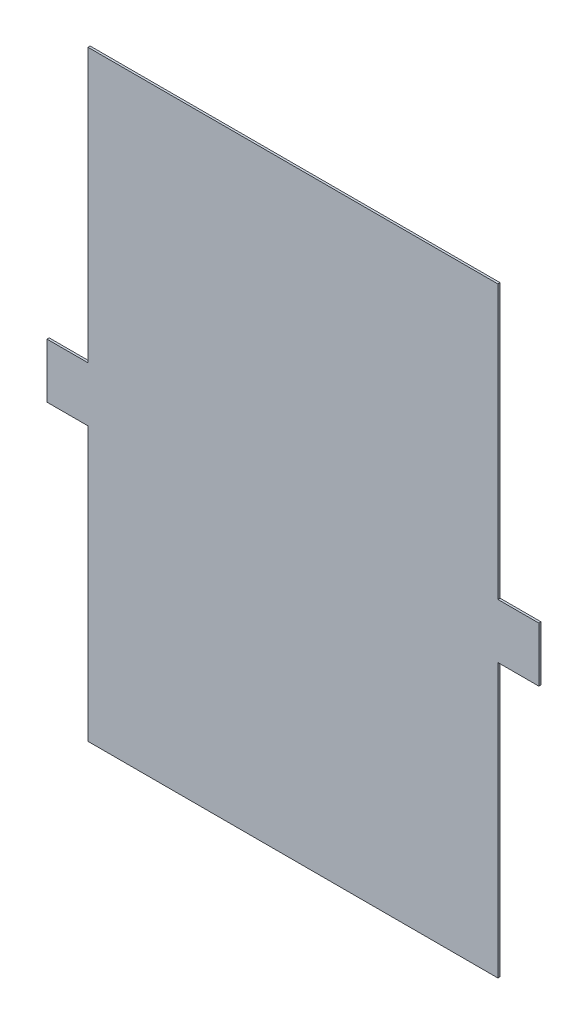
ISO-10303-21;
HEADER;
FILE_DESCRIPTION(('STEP AP214'),'2;1');
FILE_NAME('part.step','',(''),(''),'','','');
FILE_SCHEMA(('AUTOMOTIVE_DESIGN { 1 0 10303 214 1 1 1 1 }'));
ENDSEC;
DATA;
#1=APPLICATION_CONTEXT('core data for automotive mechanical design processes');
#2=APPLICATION_PROTOCOL_DEFINITION('international standard','automotive_design',2000,#1);
#3=PRODUCT_CONTEXT('',#1,'mechanical');
#4=PRODUCT('Part','Part','',(#3));
#5=PRODUCT_RELATED_PRODUCT_CATEGORY('part','',(#4));
#6=PRODUCT_DEFINITION_FORMATION('','',#4);
#7=PRODUCT_DEFINITION_CONTEXT('part definition',#1,'design');
#8=PRODUCT_DEFINITION('design','',#6,#7);
#9=PRODUCT_DEFINITION_SHAPE('','',#8);
#10=(LENGTH_UNIT() NAMED_UNIT(*) SI_UNIT(.MILLI.,.METRE.));
#11=(NAMED_UNIT(*) PLANE_ANGLE_UNIT() SI_UNIT($,.RADIAN.));
#12=(NAMED_UNIT(*) SI_UNIT($,.STERADIAN.) SOLID_ANGLE_UNIT());
#13=UNCERTAINTY_MEASURE_WITH_UNIT(LENGTH_MEASURE(1.E-05),#10,'distance_accuracy_value','');
#14=(GEOMETRIC_REPRESENTATION_CONTEXT(3) GLOBAL_UNCERTAINTY_ASSIGNED_CONTEXT((#13)) GLOBAL_UNIT_ASSIGNED_CONTEXT((#10,
#11,#12)) REPRESENTATION_CONTEXT('',''));
#15=CARTESIAN_POINT('',(0.,0.,0.));
#16=DIRECTION('',(0.,0.,1.));
#17=DIRECTION('',(1.,0.,0.));
#18=AXIS2_PLACEMENT_3D('',#15,#16,#17);
#19=CARTESIAN_POINT('',(-251.568085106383,267.960992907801,2.032));
#20=DIRECTION('',(1.,0.,0.));
#21=DIRECTION('',(0.,0.,-1.));
#22=AXIS2_PLACEMENT_3D('',#19,#20,#21);
#23=PLANE('',#22);
#24=DIRECTION('',(0.,-1.,0.));
#25=VECTOR('',#24,1.);
#26=CARTESIAN_POINT('',(-251.568085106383,267.960992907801,0.));
#27=LINE('',#26,#25);
#28=CARTESIAN_POINT('',(-251.568085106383,267.960992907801,0.));
#29=VERTEX_POINT('',#28);
#30=CARTESIAN_POINT('',(-251.568085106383,13.9609929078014,0.));
#31=VERTEX_POINT('',#30);
#32=EDGE_CURVE('E153',#29,#31,#27,.T.);
#33=ORIENTED_EDGE('',*,*,#32,.T.);
#34=DIRECTION('',(0.,0.,-1.));
#35=VECTOR('',#34,1.);
#36=CARTESIAN_POINT('',(-251.568085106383,13.9609929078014,2.032));
#37=LINE('',#36,#35);
#38=CARTESIAN_POINT('',(-251.568085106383,13.9609929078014,2.032));
#39=VERTEX_POINT('',#38);
#40=EDGE_CURVE('E11',#39,#31,#37,.T.);
#41=ORIENTED_EDGE('',*,*,#40,.F.);
#42=DIRECTION('',(0.,-1.,0.));
#43=VECTOR('',#42,1.);
#44=CARTESIAN_POINT('',(-251.568085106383,267.960992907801,2.032));
#45=LINE('',#44,#43);
#46=CARTESIAN_POINT('',(-251.568085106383,267.960992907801,2.032));
#47=VERTEX_POINT('',#46);
#48=EDGE_CURVE('E175',#47,#39,#45,.T.);
#49=ORIENTED_EDGE('',*,*,#48,.F.);
#50=DIRECTION('',(0.,0.,-1.));
#51=VECTOR('',#50,1.);
#52=CARTESIAN_POINT('',(-251.568085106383,267.960992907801,2.032));
#53=LINE('',#52,#51);
#54=EDGE_CURVE('E149',#47,#29,#53,.T.);
#55=ORIENTED_EDGE('',*,*,#54,.T.);
#56=EDGE_LOOP('',(#33,#41,#49,#55));
#57=FACE_BOUND('',#56,.T.);
#58=ADVANCED_FACE('F33',(#57),#23,.F.);
#59=CARTESIAN_POINT('',(-251.568085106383,13.9609929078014,2.032));
#60=DIRECTION('',(0.,-1.,0.));
#61=DIRECTION('',(1.,0.,0.));
#62=AXIS2_PLACEMENT_3D('',#59,#60,#61);
#63=PLANE('',#62);
#64=DIRECTION('',(-1.,0.,0.));
#65=VECTOR('',#64,1.);
#66=CARTESIAN_POINT('',(-251.568085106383,13.9609929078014,0.));
#67=LINE('',#66,#65);
#68=CARTESIAN_POINT('',(-289.668085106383,13.9609929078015,0.));
#69=VERTEX_POINT('',#68);
#70=EDGE_CURVE('E156',#31,#69,#67,.T.);
#71=ORIENTED_EDGE('',*,*,#70,.T.);
#72=DIRECTION('',(0.,0.,-1.));
#73=VECTOR('',#72,1.);
#74=CARTESIAN_POINT('',(-289.668085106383,13.9609929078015,2.032));
#75=LINE('',#74,#73);
#76=CARTESIAN_POINT('',(-289.668085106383,13.9609929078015,2.032));
#77=VERTEX_POINT('',#76);
#78=EDGE_CURVE('E41',#77,#69,#75,.T.);
#79=ORIENTED_EDGE('',*,*,#78,.F.);
#80=DIRECTION('',(-1.,0.,0.));
#81=VECTOR('',#80,1.);
#82=CARTESIAN_POINT('',(-251.568085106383,13.9609929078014,2.032));
#83=LINE('',#82,#81);
#84=EDGE_CURVE('E104',#39,#77,#83,.T.);
#85=ORIENTED_EDGE('',*,*,#84,.F.);
#86=ORIENTED_EDGE('',*,*,#40,.T.);
#87=EDGE_LOOP('',(#71,#79,#85,#86));
#88=FACE_BOUND('',#87,.T.);
#89=ADVANCED_FACE('F253',(#88),#63,.F.);
#90=CARTESIAN_POINT('',(-289.668085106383,13.9609929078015,2.032));
#91=DIRECTION('',(1.,0.,0.));
#92=DIRECTION('',(0.,0.,-1.));
#93=AXIS2_PLACEMENT_3D('',#90,#91,#92);
#94=PLANE('',#93);
#95=DIRECTION('',(0.,-1.,0.));
#96=VECTOR('',#95,1.);
#97=CARTESIAN_POINT('',(-289.668085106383,13.9609929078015,0.));
#98=LINE('',#97,#96);
#99=CARTESIAN_POINT('',(-289.668085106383,-36.8390070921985,0.));
#100=VERTEX_POINT('',#99);
#101=EDGE_CURVE('E158',#69,#100,#98,.T.);
#102=ORIENTED_EDGE('',*,*,#101,.T.);
#103=DIRECTION('',(0.,0.,-1.));
#104=VECTOR('',#103,1.);
#105=CARTESIAN_POINT('',(-289.668085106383,-36.8390070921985,2.032));
#106=LINE('',#105,#104);
#107=CARTESIAN_POINT('',(-289.668085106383,-36.8390070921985,2.032));
#108=VERTEX_POINT('',#107);
#109=EDGE_CURVE('E194',#108,#100,#106,.T.);
#110=ORIENTED_EDGE('',*,*,#109,.F.);
#111=DIRECTION('',(0.,-1.,0.));
#112=VECTOR('',#111,1.);
#113=CARTESIAN_POINT('',(-289.668085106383,13.9609929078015,2.032));
#114=LINE('',#113,#112);
#115=EDGE_CURVE('E202',#77,#108,#114,.T.);
#116=ORIENTED_EDGE('',*,*,#115,.F.);
#117=ORIENTED_EDGE('',*,*,#78,.T.);
#118=EDGE_LOOP('',(#102,#110,#116,#117));
#119=FACE_BOUND('',#118,.T.);
#120=ADVANCED_FACE('F200',(#119),#94,.F.);
#121=CARTESIAN_POINT('',(-289.668085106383,-36.8390070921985,2.032));
#122=DIRECTION('',(0.,1.,0.));
#123=DIRECTION('',(0.,0.,1.));
#124=AXIS2_PLACEMENT_3D('',#121,#122,#123);
#125=PLANE('',#124);
#126=DIRECTION('',(1.,0.,0.));
#127=VECTOR('',#126,1.);
#128=CARTESIAN_POINT('',(-289.668085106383,-36.8390070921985,0.));
#129=LINE('',#128,#127);
#130=CARTESIAN_POINT('',(-251.568085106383,-36.8390070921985,0.));
#131=VERTEX_POINT('',#130);
#132=EDGE_CURVE('E160',#100,#131,#129,.T.);
#133=ORIENTED_EDGE('',*,*,#132,.T.);
#134=DIRECTION('',(0.,0.,-1.));
#135=VECTOR('',#134,1.);
#136=CARTESIAN_POINT('',(-251.568085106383,-36.8390070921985,2.032));
#137=LINE('',#136,#135);
#138=CARTESIAN_POINT('',(-251.568085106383,-36.8390070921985,2.032));
#139=VERTEX_POINT('',#138);
#140=EDGE_CURVE('E191',#139,#131,#137,.T.);
#141=ORIENTED_EDGE('',*,*,#140,.F.);
#142=DIRECTION('',(1.,0.,0.));
#143=VECTOR('',#142,1.);
#144=CARTESIAN_POINT('',(-289.668085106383,-36.8390070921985,2.032));
#145=LINE('',#144,#143);
#146=EDGE_CURVE('E220',#108,#139,#145,.T.);
#147=ORIENTED_EDGE('',*,*,#146,.F.);
#148=ORIENTED_EDGE('',*,*,#109,.T.);
#149=EDGE_LOOP('',(#133,#141,#147,#148));
#150=FACE_BOUND('',#149,.T.);
#151=ADVANCED_FACE('F211',(#150),#125,.F.);
#152=CARTESIAN_POINT('',(-251.568085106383,-36.8390070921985,2.032));
#153=DIRECTION('',(1.,0.,0.));
#154=DIRECTION('',(0.,0.,-1.));
#155=AXIS2_PLACEMENT_3D('',#152,#153,#154);
#156=PLANE('',#155);
#157=DIRECTION('',(0.,-1.,0.));
#158=VECTOR('',#157,1.);
#159=CARTESIAN_POINT('',(-251.568085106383,-36.8390070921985,0.));
#160=LINE('',#159,#158);
#161=CARTESIAN_POINT('',(-251.568085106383,-290.839007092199,0.));
#162=VERTEX_POINT('',#161);
#163=EDGE_CURVE('E162',#131,#162,#160,.T.);
#164=ORIENTED_EDGE('',*,*,#163,.T.);
#165=DIRECTION('',(0.,0.,-1.));
#166=VECTOR('',#165,1.);
#167=CARTESIAN_POINT('',(-251.568085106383,-290.839007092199,2.032));
#168=LINE('',#167,#166);
#169=CARTESIAN_POINT('',(-251.568085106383,-290.839007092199,2.032));
#170=VERTEX_POINT('',#169);
#171=EDGE_CURVE('E188',#170,#162,#168,.T.);
#172=ORIENTED_EDGE('',*,*,#171,.F.);
#173=DIRECTION('',(0.,-1.,0.));
#174=VECTOR('',#173,1.);
#175=CARTESIAN_POINT('',(-251.568085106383,-36.8390070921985,2.032));
#176=LINE('',#175,#174);
#177=EDGE_CURVE('E217',#139,#170,#176,.T.);
#178=ORIENTED_EDGE('',*,*,#177,.F.);
#179=ORIENTED_EDGE('',*,*,#140,.T.);
#180=EDGE_LOOP('',(#164,#172,#178,#179));
#181=FACE_BOUND('',#180,.T.);
#182=ADVANCED_FACE('F215',(#181),#156,.F.);
#183=CARTESIAN_POINT('',(-251.568085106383,-290.839007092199,2.032));
#184=DIRECTION('',(0.,1.,0.));
#185=DIRECTION('',(0.,0.,1.));
#186=AXIS2_PLACEMENT_3D('',#183,#184,#185);
#187=PLANE('',#186);
#188=DIRECTION('',(1.,0.,0.));
#189=VECTOR('',#188,1.);
#190=CARTESIAN_POINT('',(-251.568085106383,-290.839007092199,0.));
#191=LINE('',#190,#189);
#192=CARTESIAN_POINT('',(129.431914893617,-290.839007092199,0.));
#193=VERTEX_POINT('',#192);
#194=EDGE_CURVE('E164',#162,#193,#191,.T.);
#195=ORIENTED_EDGE('',*,*,#194,.T.);
#196=DIRECTION('',(0.,0.,-1.));
#197=VECTOR('',#196,1.);
#198=CARTESIAN_POINT('',(129.431914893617,-290.839007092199,2.032));
#199=LINE('',#198,#197);
#200=CARTESIAN_POINT('',(129.431914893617,-290.839007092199,2.032));
#201=VERTEX_POINT('',#200);
#202=EDGE_CURVE('E185',#201,#193,#199,.T.);
#203=ORIENTED_EDGE('',*,*,#202,.F.);
#204=DIRECTION('',(1.,0.,0.));
#205=VECTOR('',#204,1.);
#206=CARTESIAN_POINT('',(-251.568085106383,-290.839007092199,2.032));
#207=LINE('',#206,#205);
#208=EDGE_CURVE('E219',#170,#201,#207,.T.);
#209=ORIENTED_EDGE('',*,*,#208,.F.);
#210=ORIENTED_EDGE('',*,*,#171,.T.);
#211=EDGE_LOOP('',(#195,#203,#209,#210));
#212=FACE_BOUND('',#211,.T.);
#213=ADVANCED_FACE('F266',(#212),#187,.F.);
#214=CARTESIAN_POINT('',(129.431914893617,-36.8390070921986,2.032));
#215=DIRECTION('',(-1.,0.,0.));
#216=DIRECTION('',(0.,0.,1.));
#217=AXIS2_PLACEMENT_3D('',#214,#215,#216);
#218=PLANE('',#217);
#219=DIRECTION('',(0.,1.,0.));
#220=VECTOR('',#219,1.);
#221=CARTESIAN_POINT('',(129.431914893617,-36.8390070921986,0.));
#222=LINE('',#221,#220);
#223=CARTESIAN_POINT('',(129.431914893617,-36.8390070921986,0.));
#224=VERTEX_POINT('',#223);
#225=EDGE_CURVE('E166',#193,#224,#222,.T.);
#226=ORIENTED_EDGE('',*,*,#225,.T.);
#227=DIRECTION('',(0.,0.,-1.));
#228=VECTOR('',#227,1.);
#229=CARTESIAN_POINT('',(129.431914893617,-36.8390070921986,2.032));
#230=LINE('',#229,#228);
#231=CARTESIAN_POINT('',(129.431914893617,-36.8390070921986,2.032));
#232=VERTEX_POINT('',#231);
#233=EDGE_CURVE('E182',#232,#224,#230,.T.);
#234=ORIENTED_EDGE('',*,*,#233,.F.);
#235=DIRECTION('',(0.,1.,0.));
#236=VECTOR('',#235,1.);
#237=CARTESIAN_POINT('',(129.431914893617,-36.8390070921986,2.032));
#238=LINE('',#237,#236);
#239=EDGE_CURVE('E222',#201,#232,#238,.T.);
#240=ORIENTED_EDGE('',*,*,#239,.F.);
#241=ORIENTED_EDGE('',*,*,#202,.T.);
#242=EDGE_LOOP('',(#226,#234,#240,#241));
#243=FACE_BOUND('',#242,.T.);
#244=ADVANCED_FACE('F269',(#243),#218,.F.);
#245=CARTESIAN_POINT('',(167.531914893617,-36.8390070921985,2.032));
#246=DIRECTION('',(0.,1.,0.));
#247=DIRECTION('',(-1.,0.,0.));
#248=AXIS2_PLACEMENT_3D('',#245,#246,#247);
#249=PLANE('',#248);
#250=DIRECTION('',(1.,0.,0.));
#251=VECTOR('',#250,1.);
#252=CARTESIAN_POINT('',(167.531914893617,-36.8390070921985,0.));
#253=LINE('',#252,#251);
#254=CARTESIAN_POINT('',(167.531914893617,-36.8390070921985,0.));
#255=VERTEX_POINT('',#254);
#256=EDGE_CURVE('E168',#224,#255,#253,.T.);
#257=ORIENTED_EDGE('',*,*,#256,.T.);
#258=DIRECTION('',(0.,0.,-1.));
#259=VECTOR('',#258,1.);
#260=CARTESIAN_POINT('',(167.531914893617,-36.8390070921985,2.032));
#261=LINE('',#260,#259);
#262=CARTESIAN_POINT('',(167.531914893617,-36.8390070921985,2.032));
#263=VERTEX_POINT('',#262);
#264=EDGE_CURVE('E179',#263,#255,#261,.T.);
#265=ORIENTED_EDGE('',*,*,#264,.F.);
#266=DIRECTION('',(1.,0.,0.));
#267=VECTOR('',#266,1.);
#268=CARTESIAN_POINT('',(167.531914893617,-36.8390070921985,2.032));
#269=LINE('',#268,#267);
#270=EDGE_CURVE('E228',#232,#263,#269,.T.);
#271=ORIENTED_EDGE('',*,*,#270,.F.);
#272=ORIENTED_EDGE('',*,*,#233,.T.);
#273=EDGE_LOOP('',(#257,#265,#271,#272));
#274=FACE_BOUND('',#273,.T.);
#275=ADVANCED_FACE('F234',(#274),#249,.F.);
#276=CARTESIAN_POINT('',(167.531914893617,13.9609929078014,2.032));
#277=DIRECTION('',(-1.,0.,0.));
#278=DIRECTION('',(0.,0.,1.));
#279=AXIS2_PLACEMENT_3D('',#276,#277,#278);
#280=PLANE('',#279);
#281=DIRECTION('',(0.,1.,0.));
#282=VECTOR('',#281,1.);
#283=CARTESIAN_POINT('',(167.531914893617,13.9609929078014,0.));
#284=LINE('',#283,#282);
#285=CARTESIAN_POINT('',(167.531914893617,13.9609929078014,0.));
#286=VERTEX_POINT('',#285);
#287=EDGE_CURVE('E170',#255,#286,#284,.T.);
#288=ORIENTED_EDGE('',*,*,#287,.T.);
#289=DIRECTION('',(0.,0.,-1.));
#290=VECTOR('',#289,1.);
#291=CARTESIAN_POINT('',(167.531914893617,13.9609929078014,2.032));
#292=LINE('',#291,#290);
#293=CARTESIAN_POINT('',(167.531914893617,13.9609929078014,2.032));
#294=VERTEX_POINT('',#293);
#295=EDGE_CURVE('E144',#294,#286,#292,.T.);
#296=ORIENTED_EDGE('',*,*,#295,.F.);
#297=DIRECTION('',(0.,1.,0.));
#298=VECTOR('',#297,1.);
#299=CARTESIAN_POINT('',(167.531914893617,13.9609929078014,2.032));
#300=LINE('',#299,#298);
#301=EDGE_CURVE('E135',#263,#294,#300,.T.);
#302=ORIENTED_EDGE('',*,*,#301,.F.);
#303=ORIENTED_EDGE('',*,*,#264,.T.);
#304=EDGE_LOOP('',(#288,#296,#302,#303));
#305=FACE_BOUND('',#304,.T.);
#306=ADVANCED_FACE('F238',(#305),#280,.F.);
#307=CARTESIAN_POINT('',(129.431914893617,13.9609929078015,2.032));
#308=DIRECTION('',(0.,-1.,0.));
#309=DIRECTION('',(1.,0.,0.));
#310=AXIS2_PLACEMENT_3D('',#307,#308,#309);
#311=PLANE('',#310);
#312=DIRECTION('',(-1.,0.,0.));
#313=VECTOR('',#312,1.);
#314=CARTESIAN_POINT('',(129.431914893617,13.9609929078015,0.));
#315=LINE('',#314,#313);
#316=CARTESIAN_POINT('',(129.431914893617,13.9609929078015,0.));
#317=VERTEX_POINT('',#316);
#318=EDGE_CURVE('E143',#286,#317,#315,.T.);
#319=ORIENTED_EDGE('',*,*,#318,.T.);
#320=DIRECTION('',(0.,0.,-1.));
#321=VECTOR('',#320,1.);
#322=CARTESIAN_POINT('',(129.431914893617,13.9609929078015,2.032));
#323=LINE('',#322,#321);
#324=CARTESIAN_POINT('',(129.431914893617,13.9609929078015,2.032));
#325=VERTEX_POINT('',#324);
#326=EDGE_CURVE('E140',#325,#317,#323,.T.);
#327=ORIENTED_EDGE('',*,*,#326,.F.);
#328=DIRECTION('',(-1.,0.,0.));
#329=VECTOR('',#328,1.);
#330=CARTESIAN_POINT('',(129.431914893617,13.9609929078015,2.032));
#331=LINE('',#330,#329);
#332=EDGE_CURVE('E129',#294,#325,#331,.T.);
#333=ORIENTED_EDGE('',*,*,#332,.F.);
#334=ORIENTED_EDGE('',*,*,#295,.T.);
#335=EDGE_LOOP('',(#319,#327,#333,#334));
#336=FACE_BOUND('',#335,.T.);
#337=ADVANCED_FACE('F141',(#336),#311,.F.);
#338=CARTESIAN_POINT('',(129.431914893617,267.960992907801,2.032));
#339=DIRECTION('',(-1.,0.,0.));
#340=DIRECTION('',(0.,-1.,0.));
#341=AXIS2_PLACEMENT_3D('',#338,#339,#340);
#342=PLANE('',#341);
#343=DIRECTION('',(0.,1.,0.));
#344=VECTOR('',#343,1.);
#345=CARTESIAN_POINT('',(129.431914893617,267.960992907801,0.));
#346=LINE('',#345,#344);
#347=CARTESIAN_POINT('',(129.431914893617,267.960992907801,0.));
#348=VERTEX_POINT('',#347);
#349=EDGE_CURVE('E90',#317,#348,#346,.T.);
#350=ORIENTED_EDGE('',*,*,#349,.T.);
#351=DIRECTION('',(0.,0.,-1.));
#352=VECTOR('',#351,1.);
#353=CARTESIAN_POINT('',(129.431914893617,267.960992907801,2.032));
#354=LINE('',#353,#352);
#355=CARTESIAN_POINT('',(129.431914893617,267.960992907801,2.032));
#356=VERTEX_POINT('',#355);
#357=EDGE_CURVE('E145',#356,#348,#354,.T.);
#358=ORIENTED_EDGE('',*,*,#357,.F.);
#359=DIRECTION('',(0.,1.,0.));
#360=VECTOR('',#359,1.);
#361=CARTESIAN_POINT('',(129.431914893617,267.960992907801,2.032));
#362=LINE('',#361,#360);
#363=EDGE_CURVE('E133',#325,#356,#362,.T.);
#364=ORIENTED_EDGE('',*,*,#363,.F.);
#365=ORIENTED_EDGE('',*,*,#326,.T.);
#366=EDGE_LOOP('',(#350,#358,#364,#365));
#367=FACE_BOUND('',#366,.T.);
#368=ADVANCED_FACE('F147',(#367),#342,.F.);
#369=CARTESIAN_POINT('',(-251.568085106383,267.960992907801,2.032));
#370=DIRECTION('',(0.,-1.,0.));
#371=DIRECTION('',(0.,0.,-1.));
#372=AXIS2_PLACEMENT_3D('',#369,#370,#371);
#373=PLANE('',#372);
#374=DIRECTION('',(-1.,0.,0.));
#375=VECTOR('',#374,1.);
#376=CARTESIAN_POINT('',(-251.568085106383,267.960992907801,0.));
#377=LINE('',#376,#375);
#378=EDGE_CURVE('E96',#348,#29,#377,.T.);
#379=ORIENTED_EDGE('',*,*,#378,.T.);
#380=ORIENTED_EDGE('',*,*,#54,.F.);
#381=DIRECTION('',(-1.,0.,0.));
#382=VECTOR('',#381,1.);
#383=CARTESIAN_POINT('',(-251.568085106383,267.960992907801,2.032));
#384=LINE('',#383,#382);
#385=EDGE_CURVE('E49',#356,#47,#384,.T.);
#386=ORIENTED_EDGE('',*,*,#385,.F.);
#387=ORIENTED_EDGE('',*,*,#357,.T.);
#388=EDGE_LOOP('',(#379,#380,#386,#387));
#389=FACE_BOUND('',#388,.T.);
#390=ADVANCED_FACE('F242',(#389),#373,.F.);
#391=CARTESIAN_POINT('',(0.,0.,2.032));
#392=DIRECTION('',(0.,0.,-1.));
#393=DIRECTION('',(-1.,0.,0.));
#394=AXIS2_PLACEMENT_3D('',#391,#392,#393);
#395=PLANE('',#394);
#396=ORIENTED_EDGE('',*,*,#48,.T.);
#397=ORIENTED_EDGE('',*,*,#84,.T.);
#398=ORIENTED_EDGE('',*,*,#115,.T.);
#399=ORIENTED_EDGE('',*,*,#146,.T.);
#400=ORIENTED_EDGE('',*,*,#177,.T.);
#401=ORIENTED_EDGE('',*,*,#208,.T.);
#402=ORIENTED_EDGE('',*,*,#239,.T.);
#403=ORIENTED_EDGE('',*,*,#270,.T.);
#404=ORIENTED_EDGE('',*,*,#301,.T.);
#405=ORIENTED_EDGE('',*,*,#332,.T.);
#406=ORIENTED_EDGE('',*,*,#363,.T.);
#407=ORIENTED_EDGE('',*,*,#385,.T.);
#408=EDGE_LOOP('',(#396,#397,#398,#399,#400,#401,#402,#403,#404,#405,#406,#407));
#409=FACE_BOUND('',#408,.T.);
#410=ADVANCED_FACE('F131',(#409),#395,.F.);
#411=CARTESIAN_POINT('',(0.,0.,0.));
#412=DIRECTION('',(0.,0.,-1.));
#413=DIRECTION('',(-1.,0.,0.));
#414=AXIS2_PLACEMENT_3D('',#411,#412,#413);
#415=PLANE('',#414);
#416=ORIENTED_EDGE('',*,*,#32,.F.);
#417=ORIENTED_EDGE('',*,*,#378,.F.);
#418=ORIENTED_EDGE('',*,*,#349,.F.);
#419=ORIENTED_EDGE('',*,*,#318,.F.);
#420=ORIENTED_EDGE('',*,*,#287,.F.);
#421=ORIENTED_EDGE('',*,*,#256,.F.);
#422=ORIENTED_EDGE('',*,*,#225,.F.);
#423=ORIENTED_EDGE('',*,*,#194,.F.);
#424=ORIENTED_EDGE('',*,*,#163,.F.);
#425=ORIENTED_EDGE('',*,*,#132,.F.);
#426=ORIENTED_EDGE('',*,*,#101,.F.);
#427=ORIENTED_EDGE('',*,*,#70,.F.);
#428=EDGE_LOOP('',(#416,#417,#418,#419,#420,#421,#422,#423,#424,#425,#426,#427));
#429=FACE_BOUND('',#428,.T.);
#430=ADVANCED_FACE('F206',(#429),#415,.T.);
#431=CLOSED_SHELL('',(#58,#89,#120,#151,#182,#213,#244,#275,#306,#337,#368,#390,#410,#430));
#432=MANIFOLD_SOLID_BREP('B2',#431);
#433=ADVANCED_BREP_SHAPE_REPRESENTATION('',(#18,#432),#14);
#434=SHAPE_DEFINITION_REPRESENTATION(#9,#433);
ENDSEC;
END-ISO-10303-21;
